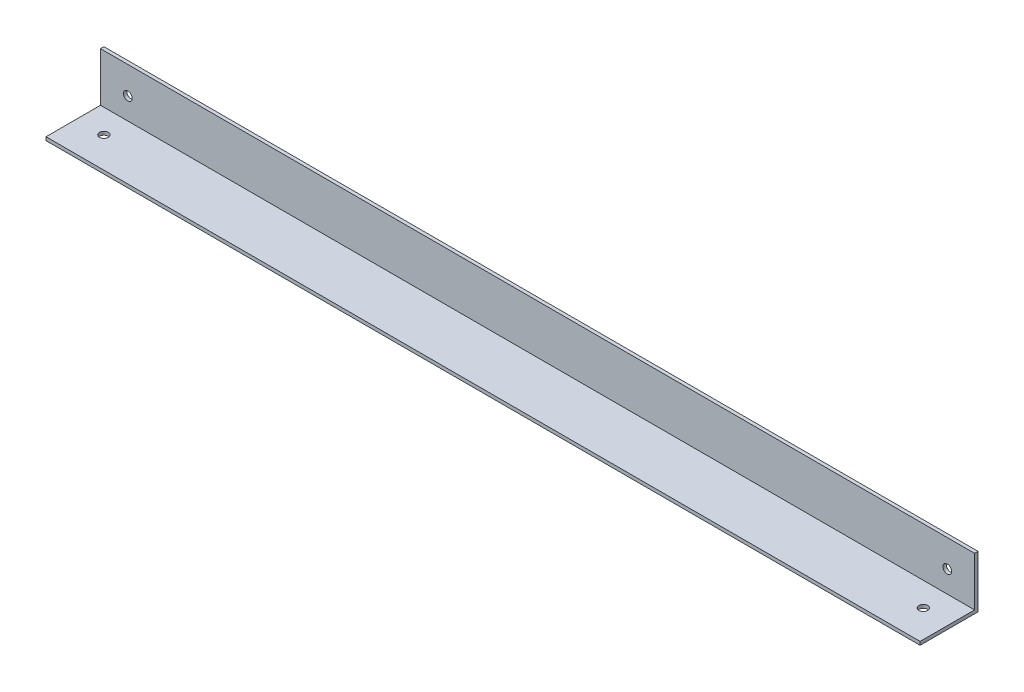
from build123d import *

# Parameters (mm, degrees)
SKETCH1_W           = 406.4
SKETCH1_H           = 24.384
BOSS_EXTRUDE1_DEPTH = 26.924
SKETCH2_W           = 406.4
SKETCH2_H           = 25.3365
CUT_EXTRUDE1_DEPTH  = 12.7
SKETCH3_W           = 406.4
SKETCH3_H           = 10.0965
CUT_EXTRUDE3_DEPTH  = 25.3365
SKETCH4_R           = 2.032
CUT_EXTRUDE4_DEPTH  = 2.54
SKETCH5_R           = 2.032
CUT_EXTRUDE5_DEPTH  = 2.54


with BuildPart() as part:
    # Sketch1 → Boss-Extrude1 (new body)
    with BuildSketch(Plane.XY):
        with Locations((-6.626086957, 55.646509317)):
            Rectangle(SKETCH1_W, SKETCH1_H)
    extrude(amount=BOSS_EXTRUDE1_DEPTH)

    # Sketch2 → Cut-Extrude1 (cut)
    with BuildSketch(Plane(origin=(0, 67.838509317, 0), x_dir=(1, 0, 0), z_dir=(0, 1, 0))):
        with Locations((-6.626086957, -14.25575)):
            Rectangle(SKETCH2_W, SKETCH2_H)
    extrude(amount=-CUT_EXTRUDE1_DEPTH, mode=Mode.SUBTRACT)

    # Sketch3 → Cut-Extrude3 (cut)
    with BuildSketch(Plane.XY.offset(26.924)):
        with Locations((-6.626086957, 50.090259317)):
            Rectangle(SKETCH3_W, SKETCH3_H)
    extrude(amount=-CUT_EXTRUDE3_DEPTH, mode=Mode.SUBTRACT)

    # Sketch4 → Cut-Extrude4 (cut)
    with BuildSketch(Plane.XZ.offset(-43.454509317)):
        with Locations(Location((-197.126086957, 12.7, 0), (0, 0, 270))):
            Circle(SKETCH4_R)
        with Locations(Location((183.873913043, 12.7, 0), (0, 0, 270))):
            Circle(SKETCH4_R)
    extrude(amount=-CUT_EXTRUDE4_DEPTH, mode=Mode.SUBTRACT)

    # Sketch5 → Cut-Extrude5 (cut)
    with BuildSketch(Plane(origin=(0, 0, 0), x_dir=(-1, 0, 0), z_dir=(0, 0, -1))):
        with Locations((-183.873913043, 55.138509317)):
            Circle(SKETCH5_R)
        with Locations((197.126086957, 55.138509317)):
            Circle(SKETCH5_R)
    extrude(amount=-CUT_EXTRUDE5_DEPTH, mode=Mode.SUBTRACT)


solid = part.part
